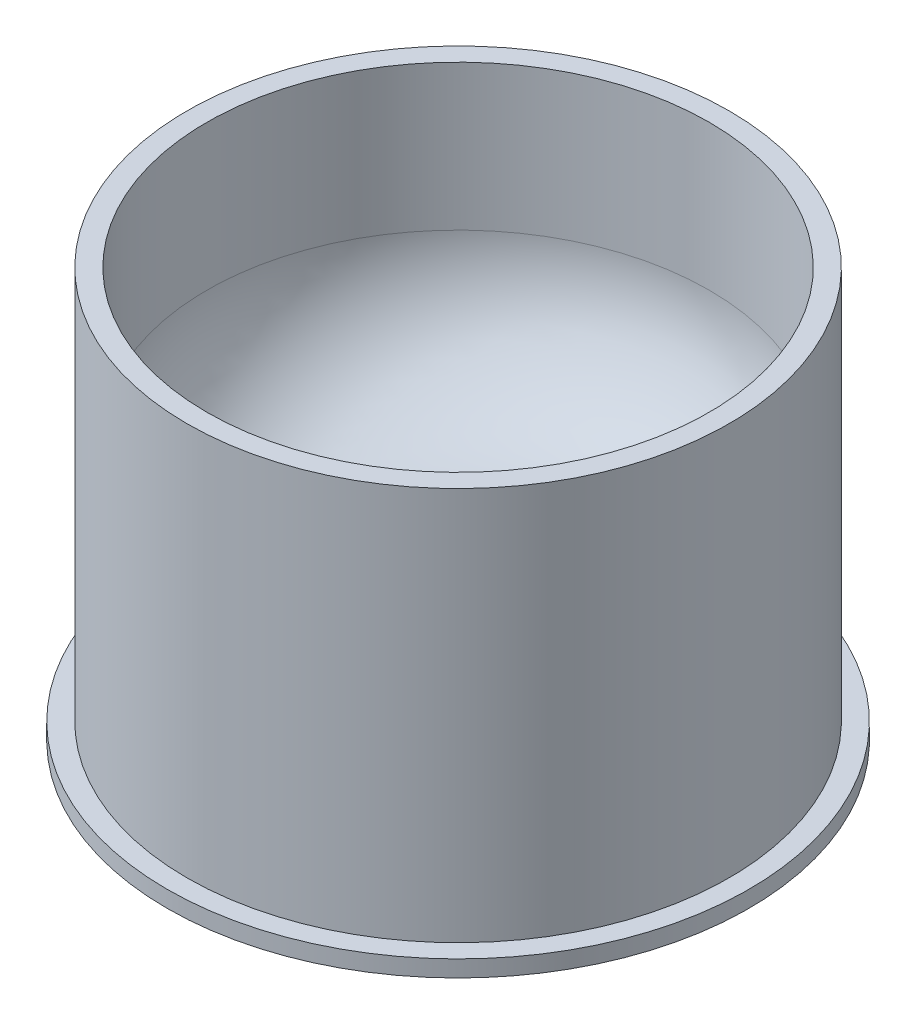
ISO-10303-21;
HEADER;
FILE_DESCRIPTION(('STEP AP214'),'2;1');
FILE_NAME('part.step','',(''),(''),'','','');
FILE_SCHEMA(('AUTOMOTIVE_DESIGN { 1 0 10303 214 1 1 1 1 }'));
ENDSEC;
DATA;
#1=APPLICATION_CONTEXT('core data for automotive mechanical design processes');
#2=APPLICATION_PROTOCOL_DEFINITION('international standard','automotive_design',2000,#1);
#3=PRODUCT_CONTEXT('',#1,'mechanical');
#4=PRODUCT('Part','Part','',(#3));
#5=PRODUCT_RELATED_PRODUCT_CATEGORY('part','',(#4));
#6=PRODUCT_DEFINITION_FORMATION('','',#4);
#7=PRODUCT_DEFINITION_CONTEXT('part definition',#1,'design');
#8=PRODUCT_DEFINITION('design','',#6,#7);
#9=PRODUCT_DEFINITION_SHAPE('','',#8);
#10=(LENGTH_UNIT() NAMED_UNIT(*) SI_UNIT(.MILLI.,.METRE.));
#11=(NAMED_UNIT(*) PLANE_ANGLE_UNIT() SI_UNIT($,.RADIAN.));
#12=(NAMED_UNIT(*) SI_UNIT($,.STERADIAN.) SOLID_ANGLE_UNIT());
#13=UNCERTAINTY_MEASURE_WITH_UNIT(LENGTH_MEASURE(1.E-05),#10,'distance_accuracy_value','');
#14=(GEOMETRIC_REPRESENTATION_CONTEXT(3) GLOBAL_UNCERTAINTY_ASSIGNED_CONTEXT((#13)) GLOBAL_UNIT_ASSIGNED_CONTEXT((#10,
#11,#12)) REPRESENTATION_CONTEXT('',''));
#15=CARTESIAN_POINT('',(0.,0.,0.));
#16=DIRECTION('',(0.,0.,1.));
#17=DIRECTION('',(1.,0.,0.));
#18=AXIS2_PLACEMENT_3D('',#15,#16,#17);
#19=CARTESIAN_POINT('',(0.,31.,0.));
#20=DIRECTION('',(0.,-1.,0.));
#21=DIRECTION('',(0.,0.,-1.));
#22=AXIS2_PLACEMENT_3D('',#19,#20,#21);
#23=CYLINDRICAL_SURFACE('',#22,20.5);
#24=CARTESIAN_POINT('',(0.,1.25,0.));
#25=DIRECTION('',(0.,1.,0.));
#26=DIRECTION('',(0.,0.,1.));
#27=AXIS2_PLACEMENT_3D('',#24,#25,#26);
#28=CIRCLE('',#27,20.5);
#29=CARTESIAN_POINT('',(0.,1.25,20.5));
#30=VERTEX_POINT('',#29);
#31=EDGE_CURVE('E57',#30,#30,#28,.T.);
#32=ORIENTED_EDGE('',*,*,#31,.T.);
#33=EDGE_LOOP('',(#32));
#34=FACE_BOUND('',#33,.T.);
#35=CARTESIAN_POINT('',(0.,31.,0.));
#36=DIRECTION('',(0.,1.,0.));
#37=DIRECTION('',(0.,0.,1.));
#38=AXIS2_PLACEMENT_3D('',#35,#36,#37);
#39=CIRCLE('',#38,20.5);
#40=CARTESIAN_POINT('',(0.,31.,20.5));
#41=VERTEX_POINT('',#40);
#42=EDGE_CURVE('E48',#41,#41,#39,.T.);
#43=ORIENTED_EDGE('',*,*,#42,.F.);
#44=EDGE_LOOP('',(#43));
#45=FACE_BOUND('',#44,.T.);
#46=ADVANCED_FACE('F33',(#34,#45),#23,.T.);
#47=CARTESIAN_POINT('',(0.,31.,0.));
#48=DIRECTION('',(0.,1.,0.));
#49=DIRECTION('',(0.,0.,1.));
#50=AXIS2_PLACEMENT_3D('',#47,#48,#49);
#51=PLANE('',#50);
#52=CARTESIAN_POINT('',(0.,31.,0.));
#53=DIRECTION('',(0.,1.,0.));
#54=DIRECTION('',(0.,0.,1.));
#55=AXIS2_PLACEMENT_3D('',#52,#53,#54);
#56=CIRCLE('',#55,19.);
#57=CARTESIAN_POINT('',(0.,31.,19.));
#58=VERTEX_POINT('',#57);
#59=EDGE_CURVE('E65',#58,#58,#56,.T.);
#60=ORIENTED_EDGE('',*,*,#59,.F.);
#61=EDGE_LOOP('',(#60));
#62=FACE_BOUND('',#61,.T.);
#63=ORIENTED_EDGE('',*,*,#42,.T.);
#64=EDGE_LOOP('',(#63));
#65=FACE_BOUND('',#64,.T.);
#66=ADVANCED_FACE('F71',(#62,#65),#51,.T.);
#67=CARTESIAN_POINT('',(0.,1.25,0.));
#68=DIRECTION('',(0.,1.,0.));
#69=DIRECTION('',(0.,0.,1.));
#70=AXIS2_PLACEMENT_3D('',#67,#68,#69);
#71=PLANE('',#70);
#72=CARTESIAN_POINT('',(0.,1.25,0.));
#73=DIRECTION('',(0.,1.,0.));
#74=DIRECTION('',(0.,0.,1.));
#75=AXIS2_PLACEMENT_3D('',#72,#73,#74);
#76=CIRCLE('',#75,22.);
#77=CARTESIAN_POINT('',(0.,1.25,22.));
#78=VERTEX_POINT('',#77);
#79=EDGE_CURVE('E53',#78,#78,#76,.T.);
#80=ORIENTED_EDGE('',*,*,#79,.T.);
#81=EDGE_LOOP('',(#80));
#82=FACE_BOUND('',#81,.T.);
#83=ORIENTED_EDGE('',*,*,#31,.F.);
#84=EDGE_LOOP('',(#83));
#85=FACE_BOUND('',#84,.T.);
#86=ADVANCED_FACE('F74',(#82,#85),#71,.T.);
#87=CARTESIAN_POINT('',(0.,1.25,0.));
#88=DIRECTION('',(0.,-1.,0.));
#89=DIRECTION('',(0.,0.,-1.));
#90=AXIS2_PLACEMENT_3D('',#87,#88,#89);
#91=CYLINDRICAL_SURFACE('',#90,22.);
#92=ORIENTED_EDGE('',*,*,#79,.F.);
#93=EDGE_LOOP('',(#92));
#94=FACE_BOUND('',#93,.T.);
#95=CARTESIAN_POINT('',(0.,0.,0.));
#96=DIRECTION('',(0.,1.,0.));
#97=DIRECTION('',(0.,0.,1.));
#98=AXIS2_PLACEMENT_3D('',#95,#96,#97);
#99=CIRCLE('',#98,22.);
#100=CARTESIAN_POINT('',(0.,0.,22.));
#101=VERTEX_POINT('',#100);
#102=EDGE_CURVE('E54',#101,#101,#99,.T.);
#103=ORIENTED_EDGE('',*,*,#102,.T.);
#104=EDGE_LOOP('',(#103));
#105=FACE_BOUND('',#104,.T.);
#106=ADVANCED_FACE('F86',(#94,#105),#91,.T.);
#107=CARTESIAN_POINT('',(0.,0.,0.));
#108=DIRECTION('',(0.,1.,0.));
#109=DIRECTION('',(0.,0.,1.));
#110=AXIS2_PLACEMENT_3D('',#107,#108,#109);
#111=PLANE('',#110);
#112=CARTESIAN_POINT('',(0.,0.,0.));
#113=DIRECTION('',(0.,-1.,0.));
#114=DIRECTION('',(0.,0.,-1.));
#115=AXIS2_PLACEMENT_3D('',#112,#113,#114);
#116=CIRCLE('',#115,17.5);
#117=CARTESIAN_POINT('',(0.,0.,-17.5));
#118=VERTEX_POINT('',#117);
#119=EDGE_CURVE('E44',#118,#118,#116,.T.);
#120=ORIENTED_EDGE('',*,*,#119,.F.);
#121=EDGE_LOOP('',(#120));
#122=FACE_BOUND('',#121,.T.);
#123=ORIENTED_EDGE('',*,*,#102,.F.);
#124=EDGE_LOOP('',(#123));
#125=FACE_BOUND('',#124,.T.);
#126=ADVANCED_FACE('F83',(#122,#125),#111,.F.);
#127=CARTESIAN_POINT('',(0.,-1.,0.));
#128=DIRECTION('',(0.,1.,0.));
#129=DIRECTION('',(0.,0.,1.));
#130=AXIS2_PLACEMENT_3D('',#127,#128,#129);
#131=CYLINDRICAL_SURFACE('',#130,17.5);
#132=CARTESIAN_POINT('',(0.,-1.,0.));
#133=DIRECTION('',(0.,-1.,0.));
#134=DIRECTION('',(0.,0.,-1.));
#135=AXIS2_PLACEMENT_3D('',#132,#133,#134);
#136=CIRCLE('',#135,17.5);
#137=CARTESIAN_POINT('',(0.,-1.,-17.5));
#138=VERTEX_POINT('',#137);
#139=EDGE_CURVE('E61',#138,#138,#136,.T.);
#140=ORIENTED_EDGE('',*,*,#139,.F.);
#141=EDGE_LOOP('',(#140));
#142=FACE_BOUND('',#141,.T.);
#143=ORIENTED_EDGE('',*,*,#119,.T.);
#144=EDGE_LOOP('',(#143));
#145=FACE_BOUND('',#144,.T.);
#146=ADVANCED_FACE('F85',(#142,#145),#131,.T.);
#147=CARTESIAN_POINT('',(0.,-1.,0.));
#148=DIRECTION('',(0.,-1.,0.));
#149=DIRECTION('',(0.,0.,-1.));
#150=AXIS2_PLACEMENT_3D('',#147,#148,#149);
#151=PLANE('',#150);
#152=ORIENTED_EDGE('',*,*,#139,.T.);
#153=EDGE_LOOP('',(#152));
#154=FACE_BOUND('',#153,.T.);
#155=ADVANCED_FACE('F97',(#154),#151,.T.);
#156=CARTESIAN_POINT('',(0.,10.,0.));
#157=DIRECTION('',(0.,1.,0.));
#158=DIRECTION('',(0.,0.,1.));
#159=AXIS2_PLACEMENT_3D('',#156,#157,#158);
#160=CYLINDRICAL_SURFACE('',#159,19.);
#161=CARTESIAN_POINT('',(0.,20.,0.));
#162=DIRECTION('',(0.,1.,0.));
#163=DIRECTION('',(0.,0.,1.));
#164=AXIS2_PLACEMENT_3D('',#161,#162,#163);
#165=CIRCLE('',#164,19.);
#166=CARTESIAN_POINT('',(0.,20.,19.));
#167=VERTEX_POINT('',#166);
#168=EDGE_CURVE('E10',#167,#167,#165,.F.);
#169=ORIENTED_EDGE('',*,*,#168,.T.);
#170=EDGE_LOOP('',(#169));
#171=FACE_BOUND('',#170,.T.);
#172=ORIENTED_EDGE('',*,*,#59,.T.);
#173=EDGE_LOOP('',(#172));
#174=FACE_BOUND('',#173,.T.);
#175=ADVANCED_FACE('F69',(#171,#174),#160,.F.);
#176=CARTESIAN_POINT('',(0.,10.,0.));
#177=DIRECTION('',(0.,1.,0.));
#178=DIRECTION('',(0.,0.,1.));
#179=AXIS2_PLACEMENT_3D('',#176,#177,#178);
#180=PLANE('',#179);
#181=CARTESIAN_POINT('',(0.,10.,0.));
#182=DIRECTION('',(0.,1.,0.));
#183=DIRECTION('',(0.,0.,1.));
#184=AXIS2_PLACEMENT_3D('',#181,#182,#183);
#185=CIRCLE('',#184,9.);
#186=CARTESIAN_POINT('',(0.,10.,9.));
#187=VERTEX_POINT('',#186);
#188=EDGE_CURVE('E40',#187,#187,#185,.T.);
#189=ORIENTED_EDGE('',*,*,#188,.T.);
#190=EDGE_LOOP('',(#189));
#191=FACE_BOUND('',#190,.T.);
#192=ADVANCED_FACE('F104',(#191),#180,.T.);
#193=CARTESIAN_POINT('',(0.,20.,0.));
#194=DIRECTION('',(0.,1.,0.));
#195=DIRECTION('',(0.,0.,1.));
#196=AXIS2_PLACEMENT_3D('',#193,#194,#195);
#197=DEGENERATE_TOROIDAL_SURFACE('',#196,9.,10.,.T.);
#198=ORIENTED_EDGE('',*,*,#168,.F.);
#199=EDGE_LOOP('',(#198));
#200=FACE_BOUND('',#199,.T.);
#201=ORIENTED_EDGE('',*,*,#188,.F.);
#202=EDGE_LOOP('',(#201));
#203=FACE_BOUND('',#202,.T.);
#204=ADVANCED_FACE('F35',(#200,#203),#197,.F.);
#205=CLOSED_SHELL('',(#46,#66,#86,#106,#126,#146,#155,#175,#192,#204));
#206=MANIFOLD_SOLID_BREP('B2',#205);
#207=ADVANCED_BREP_SHAPE_REPRESENTATION('',(#18,#206),#14);
#208=SHAPE_DEFINITION_REPRESENTATION(#9,#207);
ENDSEC;
END-ISO-10303-21;
